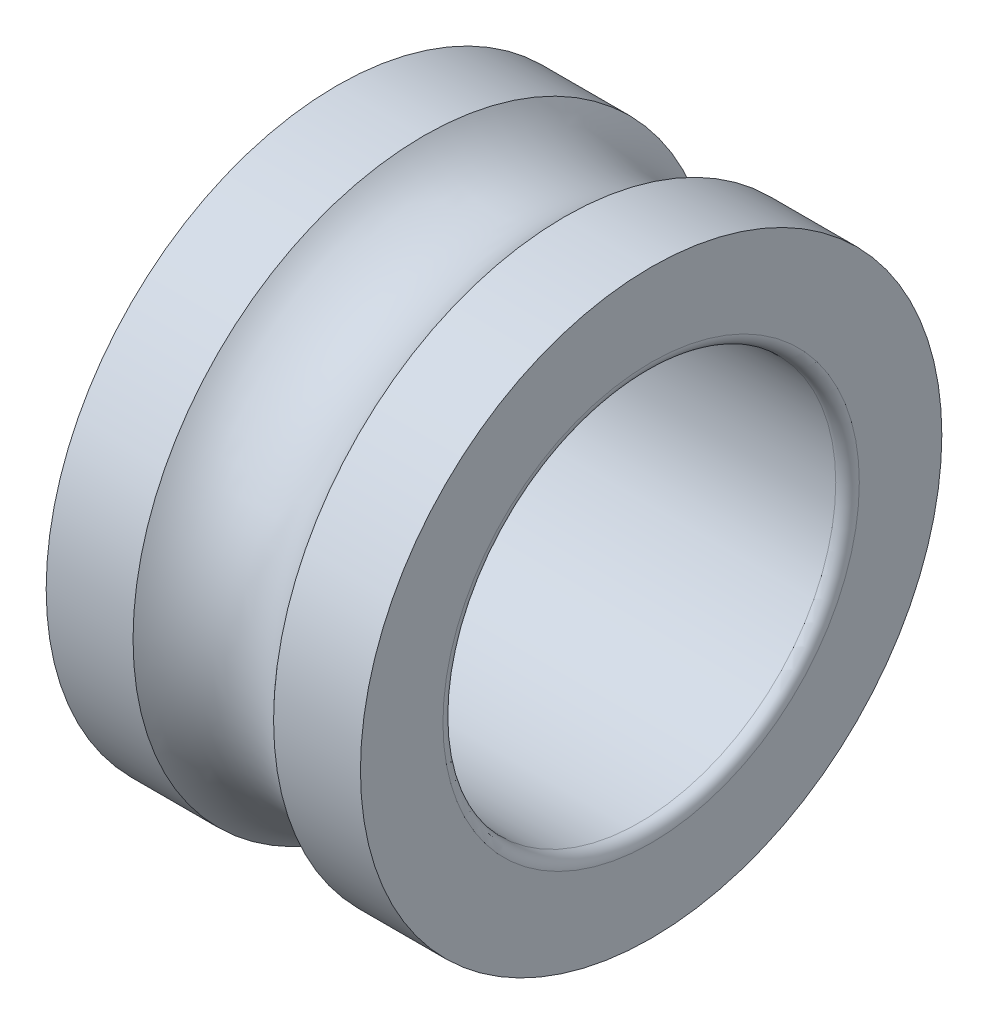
from build123d import *


with BuildPart() as part:
    # Esquisse1 → Base-R_volution (revolve)
    with BuildSketch(Plane(origin=(0, 0, 0), x_dir=(1, 0, 0), z_dir=(0, 1, 0)), mode=Mode.PRIVATE) as base_r_volution_sk:
        with BuildLine():
            Line((0, 7.4), (0, 5.3))
            ThreePointArc((0, 5.3), (0.087867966, 5.087867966), (0.3, 5))
            Line((0.3, 5), (7.7, 5))
            ThreePointArc((7.7, 5), (7.912132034, 5.087867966), (8, 5.3))
            Line((8, 5.3), (8, 7.4))
            Line((8, 7.4), (5.788854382, 7.4))
            ThreePointArc((5.788854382, 7.4), (4, 6.6), (2.211145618, 7.4))
            Line((2.211145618, 7.4), (0, 7.4))
        make_face()
    revolve(base_r_volution_sk.sketch.rotate(Axis((0, 0, 0), (1, 0, 0)), 180), axis=Axis((0, 0, 0), (1, 0, 0)))


solid = part.part
